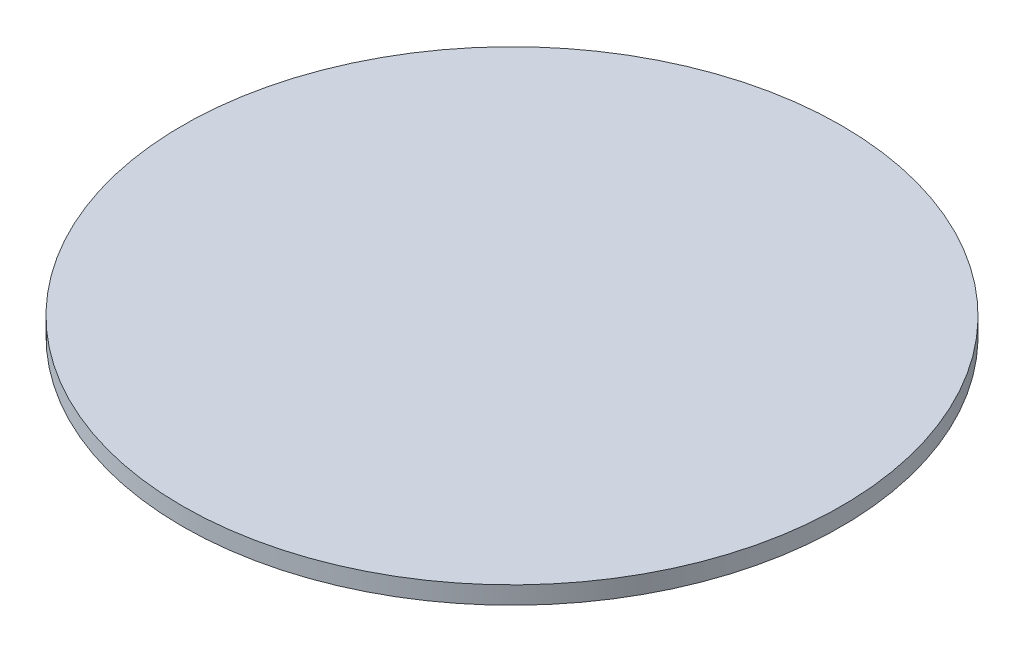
from build123d import *

# Parameters (mm, degrees)
SKETCH1_R           = 22.375
BOSS_EXTRUDE1_DEPTH = 1.2


with BuildPart() as part:
    # Sketch1 → Boss-Extrude1 (new body)
    with BuildSketch(Plane(origin=(0, 0, 0), x_dir=(1, 0, 0), z_dir=(0, 1, 0))):
        with Locations(Location((0, 0, 0), (0, 0, 270))):
            Circle(SKETCH1_R)
    extrude(amount=BOSS_EXTRUDE1_DEPTH)


solid = part.part
